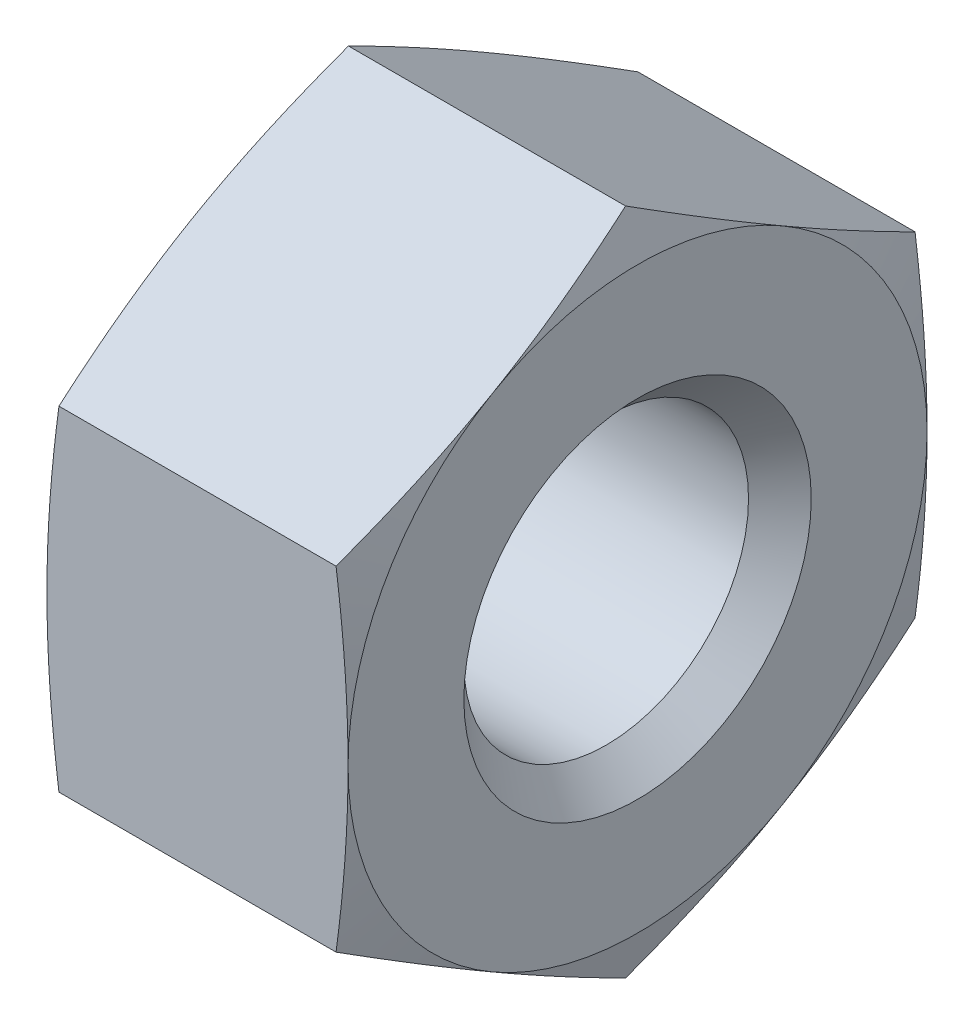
ISO-10303-21;
HEADER;
FILE_DESCRIPTION(('STEP AP214'),'2;1');
FILE_NAME('part.step','',(''),(''),'','','');
FILE_SCHEMA(('AUTOMOTIVE_DESIGN { 1 0 10303 214 1 1 1 1 }'));
ENDSEC;
DATA;
#1=APPLICATION_CONTEXT('core data for automotive mechanical design processes');
#2=APPLICATION_PROTOCOL_DEFINITION('international standard','automotive_design',2000,#1);
#3=PRODUCT_CONTEXT('',#1,'mechanical');
#4=PRODUCT('Part','Part','',(#3));
#5=PRODUCT_RELATED_PRODUCT_CATEGORY('part','',(#4));
#6=PRODUCT_DEFINITION_FORMATION('','',#4);
#7=PRODUCT_DEFINITION_CONTEXT('part definition',#1,'design');
#8=PRODUCT_DEFINITION('design','',#6,#7);
#9=PRODUCT_DEFINITION_SHAPE('','',#8);
#10=(LENGTH_UNIT() NAMED_UNIT(*) SI_UNIT(.MILLI.,.METRE.));
#11=(NAMED_UNIT(*) PLANE_ANGLE_UNIT() SI_UNIT($,.RADIAN.));
#12=(NAMED_UNIT(*) SI_UNIT($,.STERADIAN.) SOLID_ANGLE_UNIT());
#13=UNCERTAINTY_MEASURE_WITH_UNIT(LENGTH_MEASURE(1.E-05),#10,'distance_accuracy_value','');
#14=(GEOMETRIC_REPRESENTATION_CONTEXT(3) GLOBAL_UNCERTAINTY_ASSIGNED_CONTEXT((#13)) GLOBAL_UNIT_ASSIGNED_CONTEXT((#10,
#11,#12)) REPRESENTATION_CONTEXT('',''));
#15=CARTESIAN_POINT('',(0.,0.,0.));
#16=DIRECTION('',(0.,0.,1.));
#17=DIRECTION('',(1.,0.,0.));
#18=AXIS2_PLACEMENT_3D('',#15,#16,#17);
#19=CARTESIAN_POINT('',(5.2,0.,3.99999999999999));
#20=DIRECTION('',(1.,0.,0.));
#21=DIRECTION('',(0.,0.999999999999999,0.));
#22=AXIS2_PLACEMENT_3D('',#19,#20,#21);
#23=PLANE('',#22);
#24=CARTESIAN_POINT('',(5.20000000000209,0.,0.));
#25=DIRECTION('',(1.,0.,0.));
#26=DIRECTION('',(0.,0.,-0.999999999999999));
#27=AXIS2_PLACEMENT_3D('',#24,#25,#26);
#28=CIRCLE('',#27,2.99999999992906);
#29=CARTESIAN_POINT('',(5.20000000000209,0.,-2.99999999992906));
#30=VERTEX_POINT('',#29);
#31=EDGE_CURVE('E159',#30,#30,#28,.F.);
#32=ORIENTED_EDGE('',*,*,#31,.T.);
#33=EDGE_LOOP('',(#32));
#34=FACE_BOUND('',#33,.T.);
#35=CARTESIAN_POINT('',(5.19999999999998,0.,0.));
#36=DIRECTION('',(-1.,0.,0.));
#37=DIRECTION('',(0.,0.,0.999999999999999));
#38=AXIS2_PLACEMENT_3D('',#35,#36,#37);
#39=CIRCLE('',#38,4.99999999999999);
#40=CARTESIAN_POINT('',(5.2,4.33012701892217,2.5));
#41=VERTEX_POINT('',#40);
#42=CARTESIAN_POINT('',(5.19999999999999,4.33012701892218,-2.50000000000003));
#43=VERTEX_POINT('',#42);
#44=EDGE_CURVE('E103',#41,#43,#39,.T.);
#45=ORIENTED_EDGE('',*,*,#44,.F.);
#46=CARTESIAN_POINT('',(5.19999999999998,0.,0.));
#47=DIRECTION('',(-1.,0.,0.));
#48=DIRECTION('',(0.,0.,0.999999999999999));
#49=AXIS2_PLACEMENT_3D('',#46,#47,#48);
#50=CIRCLE('',#49,4.99999999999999);
#51=CARTESIAN_POINT('',(5.19999999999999,0.,4.99999999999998));
#52=VERTEX_POINT('',#51);
#53=EDGE_CURVE('E19',#52,#41,#50,.T.);
#54=ORIENTED_EDGE('',*,*,#53,.F.);
#55=CARTESIAN_POINT('',(5.19999999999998,0.,0.));
#56=DIRECTION('',(-1.,0.,0.));
#57=DIRECTION('',(0.,0.,0.999999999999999));
#58=AXIS2_PLACEMENT_3D('',#55,#56,#57);
#59=CIRCLE('',#58,4.99999999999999);
#60=CARTESIAN_POINT('',(5.20000000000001,-4.33012701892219,2.49999999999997));
#61=VERTEX_POINT('',#60);
#62=EDGE_CURVE('E427',#61,#52,#59,.T.);
#63=ORIENTED_EDGE('',*,*,#62,.F.);
#64=CARTESIAN_POINT('',(5.19999999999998,0.,0.));
#65=DIRECTION('',(-1.,0.,0.));
#66=DIRECTION('',(0.,0.,0.999999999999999));
#67=AXIS2_PLACEMENT_3D('',#64,#65,#66);
#68=CIRCLE('',#67,4.99999999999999);
#69=CARTESIAN_POINT('',(5.19999999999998,-4.33012701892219,-2.5));
#70=VERTEX_POINT('',#69);
#71=EDGE_CURVE('E429',#70,#61,#68,.T.);
#72=ORIENTED_EDGE('',*,*,#71,.F.);
#73=CARTESIAN_POINT('',(5.19999999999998,0.,0.));
#74=DIRECTION('',(-1.,0.,0.));
#75=DIRECTION('',(0.,0.,0.999999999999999));
#76=AXIS2_PLACEMENT_3D('',#73,#74,#75);
#77=CIRCLE('',#76,4.99999999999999);
#78=CARTESIAN_POINT('',(5.19999999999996,0.,-5.));
#79=VERTEX_POINT('',#78);
#80=EDGE_CURVE('E426',#79,#70,#77,.T.);
#81=ORIENTED_EDGE('',*,*,#80,.F.);
#82=CARTESIAN_POINT('',(5.19999999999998,0.,0.));
#83=DIRECTION('',(-1.,0.,0.));
#84=DIRECTION('',(0.,0.,0.999999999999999));
#85=AXIS2_PLACEMENT_3D('',#82,#83,#84);
#86=CIRCLE('',#85,4.99999999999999);
#87=EDGE_CURVE('E106',#43,#79,#86,.T.);
#88=ORIENTED_EDGE('',*,*,#87,.F.);
#89=EDGE_LOOP('',(#45,#54,#63,#72,#81,#88));
#90=FACE_BOUND('',#89,.T.);
#91=ADVANCED_FACE('F16',(#34,#90),#23,.T.);
#92=CARTESIAN_POINT('',(4.99149702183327,0.,0.));
#93=DIRECTION('',(-1.,0.,0.));
#94=DIRECTION('',(0.,0.,0.999999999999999));
#95=AXIS2_PLACEMENT_3D('',#92,#93,#94);
#96=CONICAL_SURFACE('',#95,5.77814370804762,1.30899693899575);
#97=CARTESIAN_POINT('',(4.99274057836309,2.8867513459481,4.99999999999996));
#98=CARTESIAN_POINT('',(5.02481310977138,2.64743939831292,4.99999999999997));
#99=CARTESIAN_POINT('',(5.05393652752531,2.40769790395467,4.99999999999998));
#100=CARTESIAN_POINT('',(5.10508100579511,1.92774013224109,4.99999999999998));
#101=CARTESIAN_POINT('',(5.12711010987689,1.6875247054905,4.99999999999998));
#102=CARTESIAN_POINT('',(5.16294437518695,1.20640156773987,4.99999999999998));
#103=CARTESIAN_POINT('',(5.17674759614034,0.965493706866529,4.99999999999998));
#104=CARTESIAN_POINT('',(5.19064879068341,0.603743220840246,4.99999999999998));
#105=CARTESIAN_POINT('',(5.19414863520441,0.483024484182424,4.99999999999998));
#106=CARTESIAN_POINT('',(5.1988270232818,0.241538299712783,4.99999999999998));
#107=CARTESIAN_POINT('',(5.2000054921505,0.120770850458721,4.99999999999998));
#108=CARTESIAN_POINT('',(5.2,0.,4.99999999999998));
#109=B_SPLINE_CURVE_WITH_KNOTS('',3,(#97,#98,#99,#100,#101,#102,#103,#104,#105,#106,#107,#108),
.UNSPECIFIED.,.F.,.F.,(4,2,2,2,2,4),(0.,0.724386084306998,1.44794794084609,2.17168039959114,
2.53396910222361,2.89626946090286),.UNSPECIFIED.);
#110=CARTESIAN_POINT('',(4.99274057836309,2.88675134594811,4.99999999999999));
#111=VERTEX_POINT('',#110);
#112=EDGE_CURVE('E123',#111,#52,#109,.T.);
#113=ORIENTED_EDGE('',*,*,#112,.T.);
#114=ORIENTED_EDGE('',*,*,#53,.T.);
#115=CARTESIAN_POINT('',(5.2,4.33012701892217,2.5));
#116=CARTESIAN_POINT('',(5.2000054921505,4.26974159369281,2.60459062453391));
#117=CARTESIAN_POINT('',(5.19882702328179,4.20935786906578,2.70917830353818));
#118=CARTESIAN_POINT('',(5.1941486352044,4.08861477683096,2.91831147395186));
#119=CARTESIAN_POINT('',(5.1906487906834,4.02825540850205,3.0228569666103));
#120=CARTESIAN_POINT('',(5.17674759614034,3.8473801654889,3.33614207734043));
#121=CARTESIAN_POINT('',(5.16294437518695,3.72692623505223,3.54477440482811));
#122=CARTESIAN_POINT('',(5.12711010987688,3.48636466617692,3.96143926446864));
#123=CARTESIAN_POINT('',(5.1050810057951,3.36625695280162,4.16947192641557));
#124=CARTESIAN_POINT('',(5.05393652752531,3.12627806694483,4.5851275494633));
#125=CARTESIAN_POINT('',(5.02481310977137,3.0064073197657,4.79274977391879));
#126=CARTESIAN_POINT('',(4.99274057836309,2.88675134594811,4.99999999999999));
#127=B_SPLINE_CURVE_WITH_KNOTS('',3,(#115,#116,#117,#118,#119,#120,#121,#122,#123,#124,#125,
#126),.UNSPECIFIED.,.F.,.F.,(4,2,2,2,2,4),(0.,0.362300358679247,0.724589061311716,
1.44832152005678,2.17188337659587,2.89626946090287),.UNSPECIFIED.);
#128=EDGE_CURVE('E117',#41,#111,#127,.T.);
#129=ORIENTED_EDGE('',*,*,#128,.T.);
#130=EDGE_LOOP('',(#113,#114,#129));
#131=FACE_BOUND('',#130,.T.);
#132=ADVANCED_FACE('F121',(#131),#96,.T.);
#133=CARTESIAN_POINT('',(4.99149702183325,0.,0.));
#134=DIRECTION('',(-1.,0.,0.));
#135=DIRECTION('',(0.,0.,0.999999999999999));
#136=AXIS2_PLACEMENT_3D('',#133,#134,#135);
#137=CONICAL_SURFACE('',#136,5.77814370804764,1.30899693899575);
#138=CARTESIAN_POINT('',(4.99274057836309,5.77350269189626,0.));
#139=CARTESIAN_POINT('',(5.02481310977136,5.65384671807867,0.207250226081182));
#140=CARTESIAN_POINT('',(5.05393652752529,5.53397597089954,0.414872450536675));
#141=CARTESIAN_POINT('',(5.10508100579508,5.29399708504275,0.830528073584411));
#142=CARTESIAN_POINT('',(5.12711010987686,5.17388937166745,1.03856073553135));
#143=CARTESIAN_POINT('',(5.16294437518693,4.93332780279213,1.45522559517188));
#144=CARTESIAN_POINT('',(5.17674759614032,4.81287387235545,1.66385792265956));
#145=CARTESIAN_POINT('',(5.19064879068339,4.63199862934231,1.9771430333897));
#146=CARTESIAN_POINT('',(5.19414863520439,4.5716392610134,2.08168852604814));
#147=CARTESIAN_POINT('',(5.19882702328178,4.45089616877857,2.29082169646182));
#148=CARTESIAN_POINT('',(5.20000549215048,4.39051244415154,2.39540937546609));
#149=CARTESIAN_POINT('',(5.2,4.33012701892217,2.5));
#150=B_SPLINE_CURVE_WITH_KNOTS('',3,(#138,#139,#140,#141,#142,#143,#144,#145,#146,#147,#148,
#149),.UNSPECIFIED.,.F.,.F.,(4,2,2,2,2,4),(0.,0.724386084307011,1.44794794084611,
2.17168039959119,2.53396910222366,2.89626946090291),.UNSPECIFIED.);
#151=CARTESIAN_POINT('',(4.99274057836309,5.77350269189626,0.));
#152=VERTEX_POINT('',#151);
#153=EDGE_CURVE('E111',#152,#41,#150,.T.);
#154=ORIENTED_EDGE('',*,*,#153,.T.);
#155=ORIENTED_EDGE('',*,*,#44,.T.);
#156=CARTESIAN_POINT('',(5.19999999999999,4.33012701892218,-2.50000000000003));
#157=CARTESIAN_POINT('',(5.20000549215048,4.39051244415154,-2.39540937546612));
#158=CARTESIAN_POINT('',(5.19882702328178,4.45089616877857,-2.29082169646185));
#159=CARTESIAN_POINT('',(5.19414863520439,4.5716392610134,-2.08168852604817));
#160=CARTESIAN_POINT('',(5.19064879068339,4.63199862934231,-1.97714303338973));
#161=CARTESIAN_POINT('',(5.17674759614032,4.81287387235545,-1.6638579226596));
#162=CARTESIAN_POINT('',(5.16294437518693,4.93332780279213,-1.45522559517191));
#163=CARTESIAN_POINT('',(5.12711010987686,5.17388937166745,-1.03856073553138));
#164=CARTESIAN_POINT('',(5.10508100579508,5.29399708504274,-0.830528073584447));
#165=CARTESIAN_POINT('',(5.05393652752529,5.53397597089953,-0.414872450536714));
#166=CARTESIAN_POINT('',(5.02481310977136,5.65384671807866,-0.207250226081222));
#167=CARTESIAN_POINT('',(4.9927405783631,5.77350269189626,0.));
#168=B_SPLINE_CURVE_WITH_KNOTS('',3,(#156,#157,#158,#159,#160,#161,#162,#163,#164,#165,#166,
#167),.UNSPECIFIED.,.F.,.F.,(4,2,2,2,2,4),(0.,0.362300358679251,0.724589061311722,
1.44832152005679,2.17188337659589,2.89626946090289),.UNSPECIFIED.);
#169=EDGE_CURVE('E113',#43,#152,#168,.T.);
#170=ORIENTED_EDGE('',*,*,#169,.T.);
#171=EDGE_LOOP('',(#154,#155,#170));
#172=FACE_BOUND('',#171,.T.);
#173=ADVANCED_FACE('F112',(#172),#137,.T.);
#174=CARTESIAN_POINT('',(4.99149702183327,0.,0.));
#175=DIRECTION('',(-1.,0.,0.));
#176=DIRECTION('',(0.,0.,0.999999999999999));
#177=AXIS2_PLACEMENT_3D('',#174,#175,#176);
#178=CONICAL_SURFACE('',#177,5.77814370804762,1.30899693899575);
#179=ORIENTED_EDGE('',*,*,#87,.T.);
#180=CARTESIAN_POINT('',(5.19999999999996,0.,-5.));
#181=CARTESIAN_POINT('',(5.20000549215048,0.120770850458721,-5.00000000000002));
#182=CARTESIAN_POINT('',(5.19882702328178,0.241538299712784,-5.00000000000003));
#183=CARTESIAN_POINT('',(5.19414863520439,0.483024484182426,-5.00000000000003));
#184=CARTESIAN_POINT('',(5.19064879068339,0.603743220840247,-5.00000000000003));
#185=CARTESIAN_POINT('',(5.17674759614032,0.965493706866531,-5.00000000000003));
#186=CARTESIAN_POINT('',(5.16294437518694,1.20640156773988,-5.00000000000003));
#187=CARTESIAN_POINT('',(5.12711010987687,1.6875247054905,-5.00000000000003));
#188=CARTESIAN_POINT('',(5.10508100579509,1.9277401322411,-5.00000000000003));
#189=CARTESIAN_POINT('',(5.0539365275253,2.40769790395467,-5.00000000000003));
#190=CARTESIAN_POINT('',(5.02481310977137,2.64743939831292,-5.00000000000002));
#191=CARTESIAN_POINT('',(4.9927405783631,2.88675134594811,-5.));
#192=B_SPLINE_CURVE_WITH_KNOTS('',3,(#180,#181,#182,#183,#184,#185,#186,#187,#188,#189,#190,
#191),.UNSPECIFIED.,.F.,.F.,(4,2,2,2,2,4),(0.,0.362300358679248,0.724589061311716,
1.44832152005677,2.17188337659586,2.89626946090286),.UNSPECIFIED.);
#193=CARTESIAN_POINT('',(4.9927405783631,2.88675134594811,-5.));
#194=VERTEX_POINT('',#193);
#195=EDGE_CURVE('E258',#79,#194,#192,.T.);
#196=ORIENTED_EDGE('',*,*,#195,.T.);
#197=CARTESIAN_POINT('',(4.9927405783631,2.88675134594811,-5.));
#198=CARTESIAN_POINT('',(5.02481310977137,3.00640731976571,-4.7927497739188));
#199=CARTESIAN_POINT('',(5.0539365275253,3.12627806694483,-4.58512754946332));
#200=CARTESIAN_POINT('',(5.1050810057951,3.36625695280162,-4.16947192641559));
#201=CARTESIAN_POINT('',(5.12711010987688,3.48636466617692,-3.96143926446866));
#202=CARTESIAN_POINT('',(5.16294437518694,3.72692623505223,-3.54477440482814));
#203=CARTESIAN_POINT('',(5.17674759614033,3.84738016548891,-3.33614207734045));
#204=CARTESIAN_POINT('',(5.1906487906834,4.02825540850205,-3.02285696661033));
#205=CARTESIAN_POINT('',(5.1941486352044,4.08861477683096,-2.91831147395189));
#206=CARTESIAN_POINT('',(5.19882702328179,4.20935786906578,-2.7091783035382));
#207=CARTESIAN_POINT('',(5.20000549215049,4.26974159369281,-2.60459062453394));
#208=CARTESIAN_POINT('',(5.19999999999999,4.33012701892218,-2.50000000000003));
#209=B_SPLINE_CURVE_WITH_KNOTS('',3,(#197,#198,#199,#200,#201,#202,#203,#204,#205,#206,#207,
#208),.UNSPECIFIED.,.F.,.F.,(4,2,2,2,2,4),(0.,0.724386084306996,1.44794794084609,
2.17168039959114,2.53396910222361,2.89626946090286),.UNSPECIFIED.);
#210=EDGE_CURVE('E130',#194,#43,#209,.T.);
#211=ORIENTED_EDGE('',*,*,#210,.T.);
#212=EDGE_LOOP('',(#179,#196,#211));
#213=FACE_BOUND('',#212,.T.);
#214=ADVANCED_FACE('F269',(#213),#178,.T.);
#215=CARTESIAN_POINT('',(4.99149702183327,0.,0.));
#216=DIRECTION('',(-1.,0.,0.));
#217=DIRECTION('',(0.,0.,0.999999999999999));
#218=AXIS2_PLACEMENT_3D('',#215,#216,#217);
#219=CONICAL_SURFACE('',#218,5.77814370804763,1.30899693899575);
#220=ORIENTED_EDGE('',*,*,#80,.T.);
#221=CARTESIAN_POINT('',(5.19999999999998,-4.33012701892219,-2.5));
#222=CARTESIAN_POINT('',(5.20000549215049,-4.26974159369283,-2.60459062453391));
#223=CARTESIAN_POINT('',(5.19882702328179,-4.2093578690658,-2.70917830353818));
#224=CARTESIAN_POINT('',(5.1941486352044,-4.08861477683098,-2.91831147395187));
#225=CARTESIAN_POINT('',(5.1906487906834,-4.02825540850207,-3.02285696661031));
#226=CARTESIAN_POINT('',(5.17674759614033,-3.84738016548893,-3.33614207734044));
#227=CARTESIAN_POINT('',(5.16294437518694,-3.72692623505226,-3.54477440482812));
#228=CARTESIAN_POINT('',(5.12711010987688,-3.48636466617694,-3.96143926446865));
#229=CARTESIAN_POINT('',(5.1050810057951,-3.36625695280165,-4.16947192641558));
#230=CARTESIAN_POINT('',(5.0539365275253,-3.12627806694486,-4.58512754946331));
#231=CARTESIAN_POINT('',(5.02481310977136,-3.00640731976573,-4.7927497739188));
#232=CARTESIAN_POINT('',(4.99274057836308,-2.88675134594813,-5.));
#233=B_SPLINE_CURVE_WITH_KNOTS('',3,(#221,#222,#223,#224,#225,#226,#227,#228,#229,#230,#231,
#232),.UNSPECIFIED.,.F.,.F.,(4,2,2,2,2,4),(0.,0.36230035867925,0.724589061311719,
1.44832152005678,2.17188337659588,2.89626946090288),.UNSPECIFIED.);
#234=CARTESIAN_POINT('',(4.99274057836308,-2.88675134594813,-5.));
#235=VERTEX_POINT('',#234);
#236=EDGE_CURVE('E253',#70,#235,#233,.T.);
#237=ORIENTED_EDGE('',*,*,#236,.T.);
#238=CARTESIAN_POINT('',(4.99274057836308,-2.88675134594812,-5.00000000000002));
#239=CARTESIAN_POINT('',(5.02481310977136,-2.64743939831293,-5.00000000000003));
#240=CARTESIAN_POINT('',(5.0539365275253,-2.40769790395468,-5.00000000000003));
#241=CARTESIAN_POINT('',(5.10508100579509,-1.92774013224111,-5.00000000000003));
#242=CARTESIAN_POINT('',(5.12711010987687,-1.68752470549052,-5.00000000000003));
#243=CARTESIAN_POINT('',(5.16294437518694,-1.20640156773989,-5.00000000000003));
#244=CARTESIAN_POINT('',(5.17674759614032,-0.965493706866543,-5.00000000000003));
#245=CARTESIAN_POINT('',(5.19064879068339,-0.60374322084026,-5.00000000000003));
#246=CARTESIAN_POINT('',(5.1941486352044,-0.483024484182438,-5.00000000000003));
#247=CARTESIAN_POINT('',(5.19882702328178,-0.241538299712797,-5.00000000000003));
#248=CARTESIAN_POINT('',(5.20000549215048,-0.120770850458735,-5.00000000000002));
#249=CARTESIAN_POINT('',(5.19999999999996,0.,-5.));
#250=B_SPLINE_CURVE_WITH_KNOTS('',3,(#238,#239,#240,#241,#242,#243,#244,#245,#246,#247,#248,
#249),.UNSPECIFIED.,.F.,.F.,(4,2,2,2,2,4),(0.,0.724386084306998,1.44794794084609,
2.17168039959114,2.53396910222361,2.89626946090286),.UNSPECIFIED.);
#251=EDGE_CURVE('E263',#235,#79,#250,.T.);
#252=ORIENTED_EDGE('',*,*,#251,.T.);
#253=EDGE_LOOP('',(#220,#237,#252));
#254=FACE_BOUND('',#253,.T.);
#255=ADVANCED_FACE('F272',(#254),#219,.T.);
#256=CARTESIAN_POINT('',(4.99149702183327,0.,0.));
#257=DIRECTION('',(-1.,0.,0.));
#258=DIRECTION('',(0.,0.,0.999999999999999));
#259=AXIS2_PLACEMENT_3D('',#256,#257,#258);
#260=CONICAL_SURFACE('',#259,5.77814370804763,1.30899693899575);
#261=CARTESIAN_POINT('',(4.99274057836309,-2.88675134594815,4.99999999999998));
#262=CARTESIAN_POINT('',(5.02481310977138,-3.00640731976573,4.79274977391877));
#263=CARTESIAN_POINT('',(5.05393652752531,-3.12627806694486,4.58512754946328));
#264=CARTESIAN_POINT('',(5.10508100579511,-3.36625695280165,4.16947192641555));
#265=CARTESIAN_POINT('',(5.12711010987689,-3.48636466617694,3.96143926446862));
#266=CARTESIAN_POINT('',(5.16294437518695,-3.72692623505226,3.54477440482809));
#267=CARTESIAN_POINT('',(5.17674759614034,-3.84738016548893,3.33614207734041));
#268=CARTESIAN_POINT('',(5.19064879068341,-4.02825540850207,3.02285696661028));
#269=CARTESIAN_POINT('',(5.19414863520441,-4.08861477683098,2.91831147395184));
#270=CARTESIAN_POINT('',(5.1988270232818,-4.2093578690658,2.70917830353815));
#271=CARTESIAN_POINT('',(5.2000054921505,-4.26974159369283,2.60459062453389));
#272=CARTESIAN_POINT('',(5.20000000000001,-4.33012701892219,2.49999999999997));
#273=B_SPLINE_CURVE_WITH_KNOTS('',3,(#261,#262,#263,#264,#265,#266,#267,#268,#269,#270,#271,
#272),.UNSPECIFIED.,.F.,.F.,(4,2,2,2,2,4),(0.,0.724386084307,1.44794794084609,2.17168039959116,
2.53396910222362,2.89626946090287),.UNSPECIFIED.);
#274=CARTESIAN_POINT('',(4.9927405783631,-2.88675134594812,4.99999999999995));
#275=VERTEX_POINT('',#274);
#276=EDGE_CURVE('E233',#275,#61,#273,.T.);
#277=ORIENTED_EDGE('',*,*,#276,.T.);
#278=ORIENTED_EDGE('',*,*,#62,.T.);
#279=CARTESIAN_POINT('',(5.2,0.,4.99999999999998));
#280=CARTESIAN_POINT('',(5.2000054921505,-0.120770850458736,4.99999999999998));
#281=CARTESIAN_POINT('',(5.1988270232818,-0.241538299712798,4.99999999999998));
#282=CARTESIAN_POINT('',(5.19414863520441,-0.483024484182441,4.99999999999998));
#283=CARTESIAN_POINT('',(5.19064879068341,-0.603743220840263,4.99999999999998));
#284=CARTESIAN_POINT('',(5.17674759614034,-0.965493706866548,4.99999999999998));
#285=CARTESIAN_POINT('',(5.16294437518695,-1.20640156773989,4.99999999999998));
#286=CARTESIAN_POINT('',(5.12711010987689,-1.68752470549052,4.99999999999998));
#287=CARTESIAN_POINT('',(5.10508100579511,-1.92774013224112,4.99999999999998));
#288=CARTESIAN_POINT('',(5.05393652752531,-2.40769790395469,4.99999999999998));
#289=CARTESIAN_POINT('',(5.02481310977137,-2.64743939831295,4.99999999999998));
#290=CARTESIAN_POINT('',(4.99274057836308,-2.88675134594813,4.99999999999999));
#291=B_SPLINE_CURVE_WITH_KNOTS('',3,(#279,#280,#281,#282,#283,#284,#285,#286,#287,#288,#289,
#290),.UNSPECIFIED.,.F.,.F.,(4,2,2,2,2,4),(0.,0.362300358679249,0.724589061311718,
1.44832152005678,2.17188337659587,2.89626946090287),.UNSPECIFIED.);
#292=EDGE_CURVE('E118',#52,#275,#291,.T.);
#293=ORIENTED_EDGE('',*,*,#292,.T.);
#294=EDGE_LOOP('',(#277,#278,#293));
#295=FACE_BOUND('',#294,.T.);
#296=ADVANCED_FACE('F241',(#295),#260,.T.);
#297=CARTESIAN_POINT('',(4.99149702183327,0.,0.));
#298=DIRECTION('',(-1.,0.,0.));
#299=DIRECTION('',(0.,0.,0.999999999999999));
#300=AXIS2_PLACEMENT_3D('',#297,#298,#299);
#301=CONICAL_SURFACE('',#300,5.77814370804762,1.30899693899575);
#302=ORIENTED_EDGE('',*,*,#71,.T.);
#303=CARTESIAN_POINT('',(5.20000000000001,-4.33012701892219,2.49999999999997));
#304=CARTESIAN_POINT('',(5.2000054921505,-4.39051244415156,2.39540937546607));
#305=CARTESIAN_POINT('',(5.19882702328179,-4.45089616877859,2.2908216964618));
#306=CARTESIAN_POINT('',(5.1941486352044,-4.57163926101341,2.08168852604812));
#307=CARTESIAN_POINT('',(5.1906487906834,-4.63199862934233,1.97714303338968));
#308=CARTESIAN_POINT('',(5.17674759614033,-4.81287387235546,1.66385792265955));
#309=CARTESIAN_POINT('',(5.16294437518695,-4.93332780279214,1.45522559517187));
#310=CARTESIAN_POINT('',(5.12711010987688,-5.17388937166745,1.03856073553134));
#311=CARTESIAN_POINT('',(5.1050810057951,-5.29399708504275,0.83052807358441));
#312=CARTESIAN_POINT('',(5.05393652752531,-5.53397597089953,0.414872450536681));
#313=CARTESIAN_POINT('',(5.02481310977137,-5.65384671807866,0.207250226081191));
#314=CARTESIAN_POINT('',(4.99274057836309,-5.77350269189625,0.));
#315=B_SPLINE_CURVE_WITH_KNOTS('',3,(#303,#304,#305,#306,#307,#308,#309,#310,#311,#312,#313,
#314),.UNSPECIFIED.,.F.,.F.,(4,2,2,2,2,4),(0.,0.362300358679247,0.724589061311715,
1.44832152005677,2.17188337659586,2.89626946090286),.UNSPECIFIED.);
#316=CARTESIAN_POINT('',(4.99274057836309,-5.77350269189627,0.));
#317=VERTEX_POINT('',#316);
#318=EDGE_CURVE('E228',#61,#317,#315,.T.);
#319=ORIENTED_EDGE('',*,*,#318,.T.);
#320=CARTESIAN_POINT('',(4.99274057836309,-5.77350269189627,0.));
#321=CARTESIAN_POINT('',(5.02481310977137,-5.65384671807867,-0.207250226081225));
#322=CARTESIAN_POINT('',(5.0539365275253,-5.53397597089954,-0.414872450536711));
#323=CARTESIAN_POINT('',(5.1050810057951,-5.29399708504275,-0.830528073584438));
#324=CARTESIAN_POINT('',(5.12711010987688,-5.17388937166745,-1.03856073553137));
#325=CARTESIAN_POINT('',(5.16294437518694,-4.93332780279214,-1.4552255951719));
#326=CARTESIAN_POINT('',(5.17674759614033,-4.81287387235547,-1.66385792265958));
#327=CARTESIAN_POINT('',(5.1906487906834,-4.63199862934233,-1.97714303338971));
#328=CARTESIAN_POINT('',(5.1941486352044,-4.57163926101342,-2.08168852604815));
#329=CARTESIAN_POINT('',(5.19882702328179,-4.45089616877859,-2.29082169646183));
#330=CARTESIAN_POINT('',(5.20000549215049,-4.39051244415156,-2.39540937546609));
#331=CARTESIAN_POINT('',(5.19999999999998,-4.33012701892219,-2.5));
#332=B_SPLINE_CURVE_WITH_KNOTS('',3,(#320,#321,#322,#323,#324,#325,#326,#327,#328,#329,#330,
#331),.UNSPECIFIED.,.F.,.F.,(4,2,2,2,2,4),(0.,0.724386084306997,1.44794794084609,
2.17168039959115,2.53396910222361,2.89626946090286),.UNSPECIFIED.);
#333=EDGE_CURVE('E247',#317,#70,#332,.T.);
#334=ORIENTED_EDGE('',*,*,#333,.T.);
#335=EDGE_LOOP('',(#302,#319,#334));
#336=FACE_BOUND('',#335,.T.);
#337=ADVANCED_FACE('F238',(#336),#301,.T.);
#338=CARTESIAN_POINT('',(5.20000000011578,0.,0.));
#339=DIRECTION('',(1.,0.,0.));
#340=DIRECTION('',(0.,0.,-0.999999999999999));
#341=AXIS2_PLACEMENT_3D('',#338,#339,#340);
#342=CONICAL_SURFACE('',#341,3.00000000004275,0.785398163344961);
#343=ORIENTED_EDGE('',*,*,#31,.F.);
#344=EDGE_LOOP('',(#343));
#345=FACE_BOUND('',#344,.T.);
#346=CARTESIAN_POINT('',(4.65849999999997,0.,0.));
#347=DIRECTION('',(1.,0.,0.));
#348=DIRECTION('',(0.,0.,-0.999999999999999));
#349=AXIS2_PLACEMENT_3D('',#346,#347,#348);
#350=CIRCLE('',#349,2.4585);
#351=CARTESIAN_POINT('',(4.65849999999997,0.,-2.45850000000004));
#352=VERTEX_POINT('',#351);
#353=EDGE_CURVE('E372',#352,#352,#350,.F.);
#354=ORIENTED_EDGE('',*,*,#353,.T.);
#355=EDGE_LOOP('',(#354));
#356=FACE_BOUND('',#355,.T.);
#357=ADVANCED_FACE('F169',(#345,#356),#342,.F.);
#358=CARTESIAN_POINT('',(6.2,-2.88675134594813,4.99999999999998));
#359=DIRECTION('',(0.,0.,-0.999999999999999));
#360=DIRECTION('',(-1.,0.,0.));
#361=AXIS2_PLACEMENT_3D('',#358,#359,#360);
#362=PLANE('',#361);
#363=DIRECTION('',(1.,0.,0.));
#364=VECTOR('',#363,1.);
#365=CARTESIAN_POINT('',(6.2,-2.88675134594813,4.99999999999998));
#366=LINE('',#365,#364);
#367=CARTESIAN_POINT('',(0.207259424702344,-2.88675136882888,4.99999999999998));
#368=VERTEX_POINT('',#367);
#369=EDGE_CURVE('E397',#368,#275,#366,.T.);
#370=ORIENTED_EDGE('',*,*,#369,.T.);
#371=ORIENTED_EDGE('',*,*,#292,.F.);
#372=ORIENTED_EDGE('',*,*,#112,.F.);
#373=DIRECTION('',(1.,0.,0.));
#374=VECTOR('',#373,1.);
#375=CARTESIAN_POINT('',(6.20000000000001,2.88675134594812,4.99999999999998));
#376=LINE('',#375,#374);
#377=CARTESIAN_POINT('',(0.207259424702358,2.88675133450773,5.00000001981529));
#378=VERTEX_POINT('',#377);
#379=EDGE_CURVE('E128',#111,#378,#376,.F.);
#380=ORIENTED_EDGE('',*,*,#379,.T.);
#381=CARTESIAN_POINT('',(0.,0.,4.99999999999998));
#382=CARTESIAN_POINT('',(-5.49214976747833E-06,0.120770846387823,4.99999999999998));
#383=CARTESIAN_POINT('',(0.00117297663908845,0.241538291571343,4.99999999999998));
#384=CARTESIAN_POINT('',(0.00585136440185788,0.483024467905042,4.99999999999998));
#385=CARTESIAN_POINT('',(0.00935120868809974,0.603743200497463,4.99999999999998));
#386=CARTESIAN_POINT('',(0.0232524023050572,0.965493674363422,4.99999999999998));
#387=CARTESIAN_POINT('',(0.0370556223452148,1.20640152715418,4.99999999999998));
#388=CARTESIAN_POINT('',(0.0728898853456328,1.68752464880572,4.99999999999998));
#389=CARTESIAN_POINT('',(0.094918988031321,1.92774006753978,4.99999999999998));
#390=CARTESIAN_POINT('',(0.14606346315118,2.4076978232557,4.99999999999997));
#391=CARTESIAN_POINT('',(0.175186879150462,2.64743930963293,4.99999999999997));
#392=CARTESIAN_POINT('',(0.207259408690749,2.88675124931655,4.99999999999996));
#393=B_SPLINE_CURVE_WITH_KNOTS('',3,(#381,#382,#383,#384,#385,#386,#387,#388,#389,#390,#391,
#392),.UNSPECIFIED.,.F.,.F.,(4,2,2,2,2,4),(0.,0.362300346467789,0.724589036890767,
1.44832147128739,2.17188330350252,2.89626936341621),.UNSPECIFIED.);
#394=CARTESIAN_POINT('',(0.,0.,4.99999999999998));
#395=VERTEX_POINT('',#394);
#396=EDGE_CURVE('E175',#395,#378,#393,.T.);
#397=ORIENTED_EDGE('',*,*,#396,.F.);
#398=CARTESIAN_POINT('',(0.207259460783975,-2.88675138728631,4.9999999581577));
#399=CARTESIAN_POINT('',(0.175186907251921,-2.64743943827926,4.99999998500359));
#400=CARTESIAN_POINT('',(0.146063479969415,-2.40769794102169,4.99999999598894));
#401=CARTESIAN_POINT('',(0.0949189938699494,-1.92774016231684,5.00000000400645));
#402=CARTESIAN_POINT('',(0.0728898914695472,-1.68752473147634,5.00000000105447));
#403=CARTESIAN_POINT('',(0.037055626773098,-1.20640158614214,4.99999999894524));
#404=CARTESIAN_POINT('',(0.0232524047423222,-0.965493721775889,4.99999999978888));
#405=CARTESIAN_POINT('',(0.00935120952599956,-0.603743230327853,5.00000000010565));
#406=CARTESIAN_POINT('',(0.00585136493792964,-0.483024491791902,5.00000000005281));
#407=CARTESIAN_POINT('',(0.00117297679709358,-0.241538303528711,4.99999999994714));
#408=CARTESIAN_POINT('',(-5.49206730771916E-06,-0.120770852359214,4.9999999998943));
#409=CARTESIAN_POINT('',(0.,0.,4.99999999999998));
#410=B_SPLINE_CURVE_WITH_KNOTS('',3,(#398,#399,#400,#401,#402,#403,#404,#405,#406,#407,#408,
#409),.UNSPECIFIED.,.F.,.F.,(4,2,2,2,2,4),(0.,0.724386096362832,1.44794796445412,
2.17168043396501,2.53396914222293,2.89626950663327),.UNSPECIFIED.);
#411=EDGE_CURVE('E183',#368,#395,#410,.T.);
#412=ORIENTED_EDGE('',*,*,#411,.F.);
#413=EDGE_LOOP('',(#370,#371,#372,#380,#397,#412));
#414=FACE_BOUND('',#413,.T.);
#415=ADVANCED_FACE('F165',(#414),#362,.F.);
#416=CARTESIAN_POINT('',(6.20000000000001,2.88675134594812,4.99999999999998));
#417=DIRECTION('',(0.,-0.866025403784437,-0.500000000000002));
#418=DIRECTION('',(0.,0.500000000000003,-0.866025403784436));
#419=AXIS2_PLACEMENT_3D('',#416,#417,#418);
#420=PLANE('',#419);
#421=CARTESIAN_POINT('',(0.207259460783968,2.88675128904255,5.00000001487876));
#422=CARTESIAN_POINT('',(0.17518690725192,3.0064072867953,4.79274980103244));
#423=CARTESIAN_POINT('',(0.146063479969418,3.12627804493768,4.58512757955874));
#424=CARTESIAN_POINT('',(0.0949189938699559,3.36625694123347,4.16947195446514));
#425=CARTESIAN_POINT('',(0.0728898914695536,3.48636465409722,3.96143928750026));
#426=CARTESIAN_POINT('',(0.0370556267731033,3.72692622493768,3.54477442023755));
#427=CARTESIAN_POINT('',(0.0232524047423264,3.84738015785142,3.33614209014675));
#428=CARTESIAN_POINT('',(0.00935120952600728,4.02825540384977,3.02285697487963));
#429=CARTESIAN_POINT('',(0.00585136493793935,4.08861477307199,2.91831148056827));
#430=CARTESIAN_POINT('',(0.00117297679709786,4.20935786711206,2.70917830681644));
#431=CARTESIAN_POINT('',(-5.49206731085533E-06,4.26974159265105,2.60459062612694));
#432=CARTESIAN_POINT('',(0.,4.33012701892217,2.5));
#433=B_SPLINE_CURVE_WITH_KNOTS('',3,(#421,#422,#423,#424,#425,#426,#427,#428,#429,#430,#431,
#432),.UNSPECIFIED.,.F.,.F.,(4,2,2,2,2,4),(0.,0.724386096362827,1.44794796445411,2.171680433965,
2.53396914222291,2.89626950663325),.UNSPECIFIED.);
#434=CARTESIAN_POINT('',(0.,4.33012701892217,2.5));
#435=VERTEX_POINT('',#434);
#436=EDGE_CURVE('E353',#378,#435,#433,.T.);
#437=ORIENTED_EDGE('',*,*,#436,.F.);
#438=ORIENTED_EDGE('',*,*,#379,.F.);
#439=ORIENTED_EDGE('',*,*,#128,.F.);
#440=ORIENTED_EDGE('',*,*,#153,.F.);
#441=DIRECTION('',(1.,0.,0.));
#442=VECTOR('',#441,1.);
#443=CARTESIAN_POINT('',(6.2,5.77350269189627,0.));
#444=LINE('',#443,#442);
#445=CARTESIAN_POINT('',(0.207259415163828,5.77350266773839,-4.18426959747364E-08));
#446=VERTEX_POINT('',#445);
#447=EDGE_CURVE('E402',#152,#446,#444,.F.);
#448=ORIENTED_EDGE('',*,*,#447,.T.);
#449=CARTESIAN_POINT('',(0.,4.33012701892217,2.5));
#450=CARTESIAN_POINT('',(-5.49215081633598E-06,4.39051244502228,2.39540937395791));
#451=CARTESIAN_POINT('',(0.00117297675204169,4.45089617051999,2.2908216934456));
#452=CARTESIAN_POINT('',(0.00585136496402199,4.57163926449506,2.08168852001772));
#453=CARTESIAN_POINT('',(0.0093512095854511,4.63199863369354,1.97714302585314));
#454=CARTESIAN_POINT('',(0.0232524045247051,4.81287387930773,1.66385791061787));
#455=CARTESIAN_POINT('',(0.0370556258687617,4.93332781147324,1.45522558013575));
#456=CARTESIAN_POINT('',(0.0728898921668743,5.17388938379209,1.03856071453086));
#457=CARTESIAN_POINT('',(0.0949189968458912,5.29399709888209,0.830528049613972));
#458=CARTESIAN_POINT('',(0.146063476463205,5.53397598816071,0.414872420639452));
#459=CARTESIAN_POINT('',(0.17518689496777,5.65384673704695,0.207250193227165));
#460=CARTESIAN_POINT('',(0.207259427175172,5.77350271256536,-3.57999185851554E-08));
#461=B_SPLINE_CURVE_WITH_KNOTS('',3,(#449,#450,#451,#452,#453,#454,#455,#456,#457,#458,#459,
#460),.UNSPECIFIED.,.F.,.F.,(4,2,2,2,2,4),(0.,0.362300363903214,0.724589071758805,
1.44832154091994,2.17188340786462,2.89626950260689),.UNSPECIFIED.);
#462=EDGE_CURVE('E343',#435,#446,#461,.T.);
#463=ORIENTED_EDGE('',*,*,#462,.F.);
#464=EDGE_LOOP('',(#437,#438,#439,#440,#448,#463));
#465=FACE_BOUND('',#464,.T.);
#466=ADVANCED_FACE('F127',(#465),#420,.F.);
#467=CARTESIAN_POINT('',(6.2,5.77350269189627,0.));
#468=DIRECTION('',(0.,-0.866025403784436,0.500000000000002));
#469=DIRECTION('',(0.,-0.500000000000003,-0.866025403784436));
#470=AXIS2_PLACEMENT_3D('',#467,#468,#469);
#471=PLANE('',#470);
#472=CARTESIAN_POINT('',(0.207259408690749,5.7735026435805,-8.36853641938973E-08));
#473=CARTESIAN_POINT('',(0.175186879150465,5.65384667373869,-0.207250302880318));
#474=CARTESIAN_POINT('',(0.146063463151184,5.53397593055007,-0.414872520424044));
#475=CARTESIAN_POINT('',(0.0949189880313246,5.2939970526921,-0.830528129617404));
#476=CARTESIAN_POINT('',(0.072889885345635,5.17388934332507,-1.03856078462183));
#477=CARTESIAN_POINT('',(0.0370556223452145,4.93332778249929,-1.45522563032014));
#478=CARTESIAN_POINT('',(0.0232524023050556,4.81287385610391,-1.6638579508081));
#479=CARTESIAN_POINT('',(0.0093512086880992,4.63199861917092,-1.97714305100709));
#480=CARTESIAN_POINT('',(0.00585136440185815,4.57163925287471,-2.08168854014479));
#481=CARTESIAN_POINT('',(0.00117297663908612,4.45089616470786,-2.29082170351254));
#482=CARTESIAN_POINT('',(-5.49214977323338E-06,4.3905124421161,-2.39540937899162));
#483=CARTESIAN_POINT('',(0.,4.33012701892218,-2.50000000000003));
#484=B_SPLINE_CURVE_WITH_KNOTS('',3,(#472,#473,#474,#475,#476,#477,#478,#479,#480,#481,#482,
#483),.UNSPECIFIED.,.F.,.F.,(4,2,2,2,2,4),(0.,0.724386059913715,1.44794789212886,
2.1716803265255,2.53396901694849,2.89626936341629),.UNSPECIFIED.);
#485=CARTESIAN_POINT('',(0.,4.33012701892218,-2.50000000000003));
#486=VERTEX_POINT('',#485);
#487=EDGE_CURVE('E348',#446,#486,#484,.T.);
#488=ORIENTED_EDGE('',*,*,#487,.F.);
#489=ORIENTED_EDGE('',*,*,#447,.F.);
#490=ORIENTED_EDGE('',*,*,#169,.F.);
#491=ORIENTED_EDGE('',*,*,#210,.F.);
#492=DIRECTION('',(1.,0.,0.));
#493=VECTOR('',#492,1.);
#494=CARTESIAN_POINT('',(6.2,2.88675134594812,-5.00000000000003));
#495=LINE('',#494,#493);
#496=CARTESIAN_POINT('',(0.207259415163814,2.88675129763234,-5.00000000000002));
#497=VERTEX_POINT('',#496);
#498=EDGE_CURVE('E254',#194,#497,#495,.F.);
#499=ORIENTED_EDGE('',*,*,#498,.T.);
#500=CARTESIAN_POINT('',(0.,4.33012701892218,-2.50000000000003));
#501=CARTESIAN_POINT('',(-5.49215080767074E-06,4.26974159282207,-2.60459062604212));
#502=CARTESIAN_POINT('',(0.00117297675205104,4.20935786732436,-2.70917830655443));
#503=CARTESIAN_POINT('',(0.0058513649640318,4.0886147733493,-2.91831147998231));
#504=CARTESIAN_POINT('',(0.00935120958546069,4.02825540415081,-3.02285697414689));
#505=CARTESIAN_POINT('',(0.0232524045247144,3.84738015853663,-3.33614208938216));
#506=CARTESIAN_POINT('',(0.0370556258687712,3.72692622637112,-3.54477441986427));
#507=CARTESIAN_POINT('',(0.0728898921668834,3.48636465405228,-3.96143928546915));
#508=CARTESIAN_POINT('',(0.0949189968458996,3.36625693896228,-4.16947195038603));
#509=CARTESIAN_POINT('',(0.146063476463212,3.12627804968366,-4.58512757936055));
#510=CARTESIAN_POINT('',(0.175186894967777,3.00640730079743,-4.79274980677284));
#511=CARTESIAN_POINT('',(0.207259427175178,2.88675132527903,-5.00000003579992));
#512=B_SPLINE_CURVE_WITH_KNOTS('',3,(#500,#501,#502,#503,#504,#505,#506,#507,#508,#509,#510,
#511),.UNSPECIFIED.,.F.,.F.,(4,2,2,2,2,4),(0.,0.362300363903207,0.724589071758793,
1.44832154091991,2.17188340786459,2.89626950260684),.UNSPECIFIED.);
#513=EDGE_CURVE('E320',#486,#497,#512,.T.);
#514=ORIENTED_EDGE('',*,*,#513,.F.);
#515=EDGE_LOOP('',(#488,#489,#490,#491,#499,#514));
#516=FACE_BOUND('',#515,.T.);
#517=ADVANCED_FACE('F331',(#516),#471,.F.);
#518=CARTESIAN_POINT('',(6.2,2.88675134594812,-5.00000000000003));
#519=DIRECTION('',(0.,0.,0.999999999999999));
#520=DIRECTION('',(1.,0.,0.));
#521=AXIS2_PLACEMENT_3D('',#518,#519,#520);
#522=PLANE('',#521);
#523=CARTESIAN_POINT('',(0.207259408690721,2.88675124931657,-5.));
#524=CARTESIAN_POINT('',(0.175186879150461,2.64743930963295,-5.00000000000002));
#525=CARTESIAN_POINT('',(0.14606346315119,2.40769782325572,-5.00000000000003));
#526=CARTESIAN_POINT('',(0.0949189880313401,1.9277400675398,-5.00000000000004));
#527=CARTESIAN_POINT('',(0.0728898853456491,1.68752464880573,-5.00000000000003));
#528=CARTESIAN_POINT('',(0.0370556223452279,1.20640152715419,-5.00000000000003));
#529=CARTESIAN_POINT('',(0.0232524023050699,0.965493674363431,-5.00000000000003));
#530=CARTESIAN_POINT('',(0.00935120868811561,0.603743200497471,-5.00000000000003));
#531=CARTESIAN_POINT('',(0.00585136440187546,0.483024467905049,-5.00000000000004));
#532=CARTESIAN_POINT('',(0.00117297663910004,0.24153829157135,-5.00000000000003));
#533=CARTESIAN_POINT('',(-5.49214976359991E-06,0.12077084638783,-5.00000000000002));
#534=CARTESIAN_POINT('',(0.,0.,-5.));
#535=B_SPLINE_CURVE_WITH_KNOTS('',3,(#523,#524,#525,#526,#527,#528,#529,#530,#531,#532,#533,
#534),.UNSPECIFIED.,.F.,.F.,(4,2,2,2,2,4),(0.,0.724386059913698,1.44794789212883,
2.17168032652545,2.53396901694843,2.89626936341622),.UNSPECIFIED.);
#536=CARTESIAN_POINT('',(0.,0.,-5.));
#537=VERTEX_POINT('',#536);
#538=EDGE_CURVE('E326',#497,#537,#535,.T.);
#539=ORIENTED_EDGE('',*,*,#538,.F.);
#540=ORIENTED_EDGE('',*,*,#498,.F.);
#541=ORIENTED_EDGE('',*,*,#195,.F.);
#542=ORIENTED_EDGE('',*,*,#251,.F.);
#543=DIRECTION('',(1.,0.,0.));
#544=VECTOR('',#543,1.);
#545=CARTESIAN_POINT('',(6.2,-2.88675134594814,-5.));
#546=LINE('',#545,#544);
#547=CARTESIAN_POINT('',(0.207259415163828,-2.88675137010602,-4.99999995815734));
#548=VERTEX_POINT('',#547);
#549=EDGE_CURVE('E399',#235,#548,#546,.F.);
#550=ORIENTED_EDGE('',*,*,#549,.T.);
#551=CARTESIAN_POINT('',(0.,0.,-5.));
#552=CARTESIAN_POINT('',(-5.49215080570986E-06,-0.120770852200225,-5.00000000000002));
#553=CARTESIAN_POINT('',(0.00117297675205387,-0.241538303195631,-5.00000000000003));
#554=CARTESIAN_POINT('',(0.00585136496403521,-0.483024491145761,-5.00000000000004));
#555=CARTESIAN_POINT('',(0.00935120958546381,-0.603743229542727,-5.00000000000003));
#556=CARTESIAN_POINT('',(0.0232524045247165,-0.965493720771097,-5.00000000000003));
#557=CARTESIAN_POINT('',(0.0370556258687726,-1.20640158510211,-5.00000000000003));
#558=CARTESIAN_POINT('',(0.0728898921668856,-1.68752472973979,-5.00000000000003));
#559=CARTESIAN_POINT('',(0.0949189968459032,-1.92774015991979,-5.00000000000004));
#560=CARTESIAN_POINT('',(0.146063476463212,-2.40769793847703,-5.00000000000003));
#561=CARTESIAN_POINT('',(0.175186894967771,-2.64743943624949,-5.00000000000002));
#562=CARTESIAN_POINT('',(0.207259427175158,-2.88675138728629,-5.));
#563=B_SPLINE_CURVE_WITH_KNOTS('',3,(#551,#552,#553,#554,#555,#556,#557,#558,#559,#560,#561,
#562),.UNSPECIFIED.,.F.,.F.,(4,2,2,2,2,4),(0.,0.362300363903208,0.724589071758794,
1.44832154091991,2.17188340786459,2.89626950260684),.UNSPECIFIED.);
#564=EDGE_CURVE('E309',#537,#548,#563,.T.);
#565=ORIENTED_EDGE('',*,*,#564,.F.);
#566=EDGE_LOOP('',(#539,#540,#541,#542,#550,#565));
#567=FACE_BOUND('',#566,.T.);
#568=ADVANCED_FACE('F267',(#567),#522,.F.);
#569=CARTESIAN_POINT('',(6.2,-2.88675134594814,-5.));
#570=DIRECTION('',(0.,0.866025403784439,0.499999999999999));
#571=DIRECTION('',(0.,-0.5,0.866025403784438));
#572=AXIS2_PLACEMENT_3D('',#569,#570,#571);
#573=PLANE('',#572);
#574=ORIENTED_EDGE('',*,*,#549,.F.);
#575=ORIENTED_EDGE('',*,*,#236,.F.);
#576=ORIENTED_EDGE('',*,*,#333,.F.);
#577=DIRECTION('',(1.,0.,0.));
#578=VECTOR('',#577,1.);
#579=CARTESIAN_POINT('',(6.2,-5.77350269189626,0.));
#580=LINE('',#579,#578);
#581=CARTESIAN_POINT('',(0.207259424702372,-5.77350270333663,-1.9815316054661E-08));
#582=VERTEX_POINT('',#581);
#583=EDGE_CURVE('E232',#317,#582,#580,.F.);
#584=ORIENTED_EDGE('',*,*,#583,.T.);
#585=CARTESIAN_POINT('',(0.,-4.3301270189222,-2.5));
#586=CARTESIAN_POINT('',(-5.49214976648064E-06,-4.39051244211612,-2.39540937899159));
#587=CARTESIAN_POINT('',(0.00117297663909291,-4.45089616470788,-2.29082170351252));
#588=CARTESIAN_POINT('',(0.00585136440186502,-4.57163925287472,-2.08168854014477));
#589=CARTESIAN_POINT('',(0.00935120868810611,-4.63199861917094,-1.97714305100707));
#590=CARTESIAN_POINT('',(0.023252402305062,-4.81287385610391,-1.66385795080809));
#591=CARTESIAN_POINT('',(0.0370556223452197,-4.93332778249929,-1.45522563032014));
#592=CARTESIAN_POINT('',(0.0728898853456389,-5.17388934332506,-1.03856078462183));
#593=CARTESIAN_POINT('',(0.0949189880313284,-5.2939970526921,-0.830528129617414));
#594=CARTESIAN_POINT('',(0.146063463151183,-5.53397593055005,-0.414872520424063));
#595=CARTESIAN_POINT('',(0.17518687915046,-5.65384667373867,-0.207250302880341));
#596=CARTESIAN_POINT('',(0.207259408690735,-5.77350264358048,-8.36853919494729E-08));
#597=B_SPLINE_CURVE_WITH_KNOTS('',3,(#585,#586,#587,#588,#589,#590,#591,#592,#593,#594,#595,
#596),.UNSPECIFIED.,.F.,.F.,(4,2,2,2,2,4),(0.,0.362300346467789,0.724589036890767,
1.44832147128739,2.17188330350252,2.89626936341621),.UNSPECIFIED.);
#598=CARTESIAN_POINT('',(0.,-4.33012701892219,-2.50000000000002));
#599=VERTEX_POINT('',#598);
#600=EDGE_CURVE('E34',#599,#582,#597,.T.);
#601=ORIENTED_EDGE('',*,*,#600,.F.);
#602=CARTESIAN_POINT('',(0.207259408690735,-2.88675139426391,-4.99999991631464));
#603=CARTESIAN_POINT('',(0.175186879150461,-3.00640736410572,-4.79274969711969));
#604=CARTESIAN_POINT('',(0.146063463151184,-3.12627810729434,-4.58512747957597));
#605=CARTESIAN_POINT('',(0.0949189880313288,-3.3662569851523,-4.16947187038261));
#606=CARTESIAN_POINT('',(0.0728898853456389,-3.48636469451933,-3.96143921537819));
#607=CARTESIAN_POINT('',(0.0370556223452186,-3.7269262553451,-3.54477436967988));
#608=CARTESIAN_POINT('',(0.0232524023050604,-3.84738018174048,-3.33614204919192));
#609=CARTESIAN_POINT('',(0.00935120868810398,-4.02825541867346,-3.02285694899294));
#610=CARTESIAN_POINT('',(0.00585136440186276,-4.08861478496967,-2.91831145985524));
#611=CARTESIAN_POINT('',(0.0011729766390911,-4.20935787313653,-2.70917829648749));
#612=CARTESIAN_POINT('',(-5.49214976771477E-06,-4.26974159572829,-2.60459062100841));
#613=CARTESIAN_POINT('',(0.,-4.3301270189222,-2.5));
#614=B_SPLINE_CURVE_WITH_KNOTS('',3,(#602,#603,#604,#605,#606,#607,#608,#609,#610,#611,#612,
#613),.UNSPECIFIED.,.F.,.F.,(4,2,2,2,2,4),(0.,0.724386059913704,1.44794789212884,
2.17168032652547,2.53396901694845,2.89626936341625),.UNSPECIFIED.);
#615=EDGE_CURVE('E315',#548,#599,#614,.T.);
#616=ORIENTED_EDGE('',*,*,#615,.F.);
#617=EDGE_LOOP('',(#574,#575,#576,#584,#601,#616));
#618=FACE_BOUND('',#617,.T.);
#619=ADVANCED_FACE('F212',(#618),#573,.F.);
#620=CARTESIAN_POINT('',(6.2,-5.77350269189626,0.));
#621=DIRECTION('',(0.,0.866025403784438,-0.499999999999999));
#622=DIRECTION('',(0.,0.5,0.866025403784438));
#623=AXIS2_PLACEMENT_3D('',#620,#621,#622);
#624=PLANE('',#623);
#625=ORIENTED_EDGE('',*,*,#583,.F.);
#626=ORIENTED_EDGE('',*,*,#318,.F.);
#627=ORIENTED_EDGE('',*,*,#276,.F.);
#628=ORIENTED_EDGE('',*,*,#369,.F.);
#629=CARTESIAN_POINT('',(0.,-4.33012701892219,2.49999999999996));
#630=CARTESIAN_POINT('',(-5.49214976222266E-06,-4.26974159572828,2.60459062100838));
#631=CARTESIAN_POINT('',(0.00117297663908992,-4.20935787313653,2.70917829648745));
#632=CARTESIAN_POINT('',(0.00585136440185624,-4.08861478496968,2.91831145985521));
#633=CARTESIAN_POINT('',(0.00935120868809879,-4.02825541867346,3.02285694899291));
#634=CARTESIAN_POINT('',(0.0232524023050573,-3.84738018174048,3.33614204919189));
#635=CARTESIAN_POINT('',(0.0370556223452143,-3.7269262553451,3.54477436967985));
#636=CARTESIAN_POINT('',(0.0728898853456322,-3.48636469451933,3.96143921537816));
#637=CARTESIAN_POINT('',(0.0949189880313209,-3.3662569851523,4.16947187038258));
#638=CARTESIAN_POINT('',(0.146063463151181,-3.12627810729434,4.58512747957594));
#639=CARTESIAN_POINT('',(0.175186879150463,-3.00640736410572,4.79274969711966));
#640=CARTESIAN_POINT('',(0.207259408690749,-2.88675139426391,4.99999991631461));
#641=B_SPLINE_CURVE_WITH_KNOTS('',3,(#629,#630,#631,#632,#633,#634,#635,#636,#637,#638,#639,
#640),.UNSPECIFIED.,.F.,.F.,(4,2,2,2,2,4),(0.,0.362300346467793,0.724589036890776,
1.44832147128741,2.17188330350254,2.89626936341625),.UNSPECIFIED.);
#642=CARTESIAN_POINT('',(0.,-4.33012701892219,2.49999999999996));
#643=VERTEX_POINT('',#642);
#644=EDGE_CURVE('E190',#643,#368,#641,.T.);
#645=ORIENTED_EDGE('',*,*,#644,.F.);
#646=CARTESIAN_POINT('',(0.207259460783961,-5.77350267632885,-5.67210722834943E-08));
#647=CARTESIAN_POINT('',(0.17518690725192,-5.65384672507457,0.207250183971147));
#648=CARTESIAN_POINT('',(0.146063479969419,-5.53397598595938,0.4148724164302));
#649=CARTESIAN_POINT('',(0.094918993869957,-5.29399710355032,0.830528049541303));
#650=CARTESIAN_POINT('',(0.0728898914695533,-5.17388938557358,1.0385607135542));
#651=CARTESIAN_POINT('',(0.0370556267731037,-4.93332781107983,1.45522557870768));
#652=CARTESIAN_POINT('',(0.0232524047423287,-4.81287387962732,1.66385790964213));
#653=CARTESIAN_POINT('',(0.00935120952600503,-4.63199863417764,1.97714302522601));
#654=CARTESIAN_POINT('',(0.00585136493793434,-4.57163926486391,2.08168851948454));
#655=CARTESIAN_POINT('',(0.0011729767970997,-4.45089617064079,2.2908216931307));
#656=CARTESIAN_POINT('',(-5.49206729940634E-06,-4.39051244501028,2.39540937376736));
#657=CARTESIAN_POINT('',(0.,-4.33012701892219,2.49999999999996));
#658=B_SPLINE_CURVE_WITH_KNOTS('',3,(#646,#647,#648,#649,#650,#651,#652,#653,#654,#655,#656,
#657),.UNSPECIFIED.,.F.,.F.,(4,2,2,2,2,4),(0.,0.724386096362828,1.44794796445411,2.171680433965,
2.53396914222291,2.89626950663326),.UNSPECIFIED.);
#659=EDGE_CURVE('E219',#582,#643,#658,.T.);
#660=ORIENTED_EDGE('',*,*,#659,.F.);
#661=EDGE_LOOP('',(#625,#626,#627,#628,#645,#660));
#662=FACE_BOUND('',#661,.T.);
#663=ADVANCED_FACE('F207',(#662),#624,.F.);
#664=CARTESIAN_POINT('',(2.59999999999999,0.,0.));
#665=DIRECTION('',(1.,0.,0.));
#666=DIRECTION('',(0.,0.,-0.999999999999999));
#667=AXIS2_PLACEMENT_3D('',#664,#665,#666);
#668=CYLINDRICAL_SURFACE('',#667,2.4585);
#669=ORIENTED_EDGE('',*,*,#353,.F.);
#670=EDGE_LOOP('',(#669));
#671=FACE_BOUND('',#670,.T.);
#672=CARTESIAN_POINT('',(0.541500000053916,0.,0.));
#673=DIRECTION('',(-1.,0.,0.));
#674=DIRECTION('',(0.,0.,0.999999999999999));
#675=AXIS2_PLACEMENT_3D('',#672,#673,#674);
#676=CIRCLE('',#675,2.45849999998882);
#677=CARTESIAN_POINT('',(0.541500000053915,0.,2.45849999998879));
#678=VERTEX_POINT('',#677);
#679=EDGE_CURVE('E391',#678,#678,#676,.T.);
#680=ORIENTED_EDGE('',*,*,#679,.T.);
#681=EDGE_LOOP('',(#680));
#682=FACE_BOUND('',#681,.T.);
#683=ADVANCED_FACE('F201',(#671,#682),#668,.F.);
#684=CARTESIAN_POINT('',(0.208502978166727,0.,0.));
#685=DIRECTION('',(1.,0.,0.));
#686=DIRECTION('',(0.,0.,-0.999999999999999));
#687=AXIS2_PLACEMENT_3D('',#684,#685,#686);
#688=CONICAL_SURFACE('',#687,5.77814370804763,1.30899693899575);
#689=ORIENTED_EDGE('',*,*,#411,.T.);
#690=CARTESIAN_POINT('',(0.,0.,0.));
#691=DIRECTION('',(1.,0.,0.));
#692=DIRECTION('',(0.,0.,-0.999999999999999));
#693=AXIS2_PLACEMENT_3D('',#690,#691,#692);
#694=CIRCLE('',#693,5.);
#695=EDGE_CURVE('E369',#643,#395,#694,.F.);
#696=ORIENTED_EDGE('',*,*,#695,.F.);
#697=ORIENTED_EDGE('',*,*,#644,.T.);
#698=EDGE_LOOP('',(#689,#696,#697));
#699=FACE_BOUND('',#698,.T.);
#700=ADVANCED_FACE('F196',(#699),#688,.T.);
#701=CARTESIAN_POINT('',(0.208502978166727,0.,0.));
#702=DIRECTION('',(1.,0.,0.));
#703=DIRECTION('',(0.,0.,-0.999999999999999));
#704=AXIS2_PLACEMENT_3D('',#701,#702,#703);
#705=CONICAL_SURFACE('',#704,5.77814370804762,1.30899693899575);
#706=ORIENTED_EDGE('',*,*,#436,.T.);
#707=CARTESIAN_POINT('',(0.,0.,0.));
#708=DIRECTION('',(1.,0.,0.));
#709=DIRECTION('',(0.,0.,-0.999999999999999));
#710=AXIS2_PLACEMENT_3D('',#707,#708,#709);
#711=CIRCLE('',#710,4.99999999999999);
#712=EDGE_CURVE('E363',#395,#435,#711,.F.);
#713=ORIENTED_EDGE('',*,*,#712,.F.);
#714=ORIENTED_EDGE('',*,*,#396,.T.);
#715=EDGE_LOOP('',(#706,#713,#714));
#716=FACE_BOUND('',#715,.T.);
#717=ADVANCED_FACE('F200',(#716),#705,.T.);
#718=CARTESIAN_POINT('',(0.208502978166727,0.,0.));
#719=DIRECTION('',(1.,0.,0.));
#720=DIRECTION('',(0.,0.,-0.999999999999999));
#721=AXIS2_PLACEMENT_3D('',#718,#719,#720);
#722=CONICAL_SURFACE('',#721,5.77814370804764,1.30899693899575);
#723=CARTESIAN_POINT('',(0.,0.,0.));
#724=DIRECTION('',(1.,0.,0.));
#725=DIRECTION('',(0.,0.,-0.999999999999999));
#726=AXIS2_PLACEMENT_3D('',#723,#724,#725);
#727=CIRCLE('',#726,5.);
#728=EDGE_CURVE('E388',#435,#486,#727,.F.);
#729=ORIENTED_EDGE('',*,*,#728,.F.);
#730=ORIENTED_EDGE('',*,*,#462,.T.);
#731=ORIENTED_EDGE('',*,*,#487,.T.);
#732=EDGE_LOOP('',(#729,#730,#731));
#733=FACE_BOUND('',#732,.T.);
#734=ADVANCED_FACE('F336',(#733),#722,.T.);
#735=CARTESIAN_POINT('',(0.208502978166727,0.,0.));
#736=DIRECTION('',(1.,0.,0.));
#737=DIRECTION('',(0.,0.,-0.999999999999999));
#738=AXIS2_PLACEMENT_3D('',#735,#736,#737);
#739=CONICAL_SURFACE('',#738,5.77814370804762,1.30899693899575);
#740=CARTESIAN_POINT('',(0.,0.,0.));
#741=DIRECTION('',(1.,0.,0.));
#742=DIRECTION('',(0.,0.,-0.999999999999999));
#743=AXIS2_PLACEMENT_3D('',#740,#741,#742);
#744=CIRCLE('',#743,5.);
#745=EDGE_CURVE('E385',#486,#537,#744,.F.);
#746=ORIENTED_EDGE('',*,*,#745,.F.);
#747=ORIENTED_EDGE('',*,*,#513,.T.);
#748=ORIENTED_EDGE('',*,*,#538,.T.);
#749=EDGE_LOOP('',(#746,#747,#748));
#750=FACE_BOUND('',#749,.T.);
#751=ADVANCED_FACE('F333',(#750),#739,.T.);
#752=CARTESIAN_POINT('',(0.208502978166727,0.,0.));
#753=DIRECTION('',(1.,0.,0.));
#754=DIRECTION('',(0.,0.,-0.999999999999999));
#755=AXIS2_PLACEMENT_3D('',#752,#753,#754);
#756=CONICAL_SURFACE('',#755,5.77814370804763,1.30899693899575);
#757=CARTESIAN_POINT('',(0.,0.,0.));
#758=DIRECTION('',(1.,0.,0.));
#759=DIRECTION('',(0.,0.,-0.999999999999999));
#760=AXIS2_PLACEMENT_3D('',#757,#758,#759);
#761=CIRCLE('',#760,4.99999999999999);
#762=EDGE_CURVE('E382',#537,#599,#761,.F.);
#763=ORIENTED_EDGE('',*,*,#762,.F.);
#764=ORIENTED_EDGE('',*,*,#564,.T.);
#765=ORIENTED_EDGE('',*,*,#615,.T.);
#766=EDGE_LOOP('',(#763,#764,#765));
#767=FACE_BOUND('',#766,.T.);
#768=ADVANCED_FACE('F300',(#767),#756,.T.);
#769=CARTESIAN_POINT('',(0.208502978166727,0.,0.));
#770=DIRECTION('',(1.,0.,0.));
#771=DIRECTION('',(0.,0.,-0.999999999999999));
#772=AXIS2_PLACEMENT_3D('',#769,#770,#771);
#773=CONICAL_SURFACE('',#772,5.77814370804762,1.30899693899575);
#774=ORIENTED_EDGE('',*,*,#659,.T.);
#775=CARTESIAN_POINT('',(0.,0.,0.));
#776=DIRECTION('',(1.,0.,0.));
#777=DIRECTION('',(0.,0.,-0.999999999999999));
#778=AXIS2_PLACEMENT_3D('',#775,#776,#777);
#779=CIRCLE('',#778,4.99999999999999);
#780=EDGE_CURVE('E25',#599,#643,#779,.F.);
#781=ORIENTED_EDGE('',*,*,#780,.F.);
#782=ORIENTED_EDGE('',*,*,#600,.T.);
#783=EDGE_LOOP('',(#774,#781,#782));
#784=FACE_BOUND('',#783,.T.);
#785=ADVANCED_FACE('F293',(#784),#773,.T.);
#786=CARTESIAN_POINT('',(-1.13686837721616E-10,0.,0.));
#787=DIRECTION('',(-1.,0.,0.));
#788=DIRECTION('',(0.,0.,0.999999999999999));
#789=AXIS2_PLACEMENT_3D('',#786,#787,#788);
#790=CONICAL_SURFACE('',#789,3.00000000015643,0.785398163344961);
#791=ORIENTED_EDGE('',*,*,#679,.F.);
#792=EDGE_LOOP('',(#791));
#793=FACE_BOUND('',#792,.T.);
#794=CARTESIAN_POINT('',(-5.6843418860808E-11,0.,0.));
#795=DIRECTION('',(-1.,0.,0.));
#796=DIRECTION('',(0.,0.,0.999999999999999));
#797=AXIS2_PLACEMENT_3D('',#794,#795,#796);
#798=CIRCLE('',#797,3.00000000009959);
#799=CARTESIAN_POINT('',(-5.68439184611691E-11,0.,3.00000000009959));
#800=VERTEX_POINT('',#799);
#801=EDGE_CURVE('E11',#800,#800,#798,.F.);
#802=ORIENTED_EDGE('',*,*,#801,.F.);
#803=EDGE_LOOP('',(#802));
#804=FACE_BOUND('',#803,.T.);
#805=ADVANCED_FACE('F287',(#793,#804),#790,.F.);
#806=CARTESIAN_POINT('',(0.,0.,3.99999999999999));
#807=DIRECTION('',(-1.,0.,0.));
#808=DIRECTION('',(0.,0.,0.999999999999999));
#809=AXIS2_PLACEMENT_3D('',#806,#807,#808);
#810=PLANE('',#809);
#811=ORIENTED_EDGE('',*,*,#801,.T.);
#812=EDGE_LOOP('',(#811));
#813=FACE_BOUND('',#812,.T.);
#814=ORIENTED_EDGE('',*,*,#762,.T.);
#815=ORIENTED_EDGE('',*,*,#780,.T.);
#816=ORIENTED_EDGE('',*,*,#695,.T.);
#817=ORIENTED_EDGE('',*,*,#712,.T.);
#818=ORIENTED_EDGE('',*,*,#728,.T.);
#819=ORIENTED_EDGE('',*,*,#745,.T.);
#820=EDGE_LOOP('',(#814,#815,#816,#817,#818,#819));
#821=FACE_BOUND('',#820,.T.);
#822=ADVANCED_FACE('F285',(#813,#821),#810,.T.);
#823=CLOSED_SHELL('',(#91,#132,#173,#214,#255,#296,#337,#357,#415,#466,#517,#568,#619,#663,#683,
#700,#717,#734,#751,#768,#785,#805,#822));
#824=MANIFOLD_SOLID_BREP('B1',#823);
#825=ADVANCED_BREP_SHAPE_REPRESENTATION('',(#18,#824),#14);
#826=SHAPE_DEFINITION_REPRESENTATION(#9,#825);
ENDSEC;
END-ISO-10303-21;
